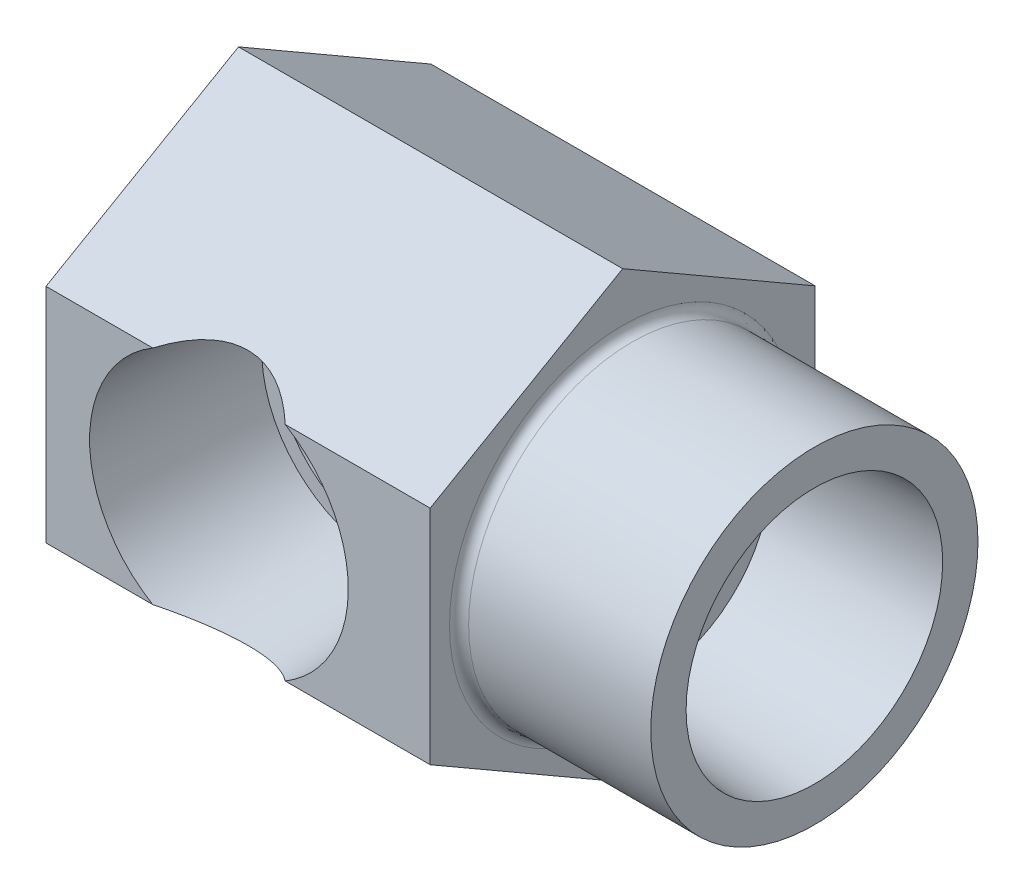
ISO-10303-21;
HEADER;
FILE_DESCRIPTION(('STEP AP214'),'2;1');
FILE_NAME('part.step','',(''),(''),'','','');
FILE_SCHEMA(('AUTOMOTIVE_DESIGN { 1 0 10303 214 1 1 1 1 }'));
ENDSEC;
DATA;
#1=APPLICATION_CONTEXT('core data for automotive mechanical design processes');
#2=APPLICATION_PROTOCOL_DEFINITION('international standard','automotive_design',2000,#1);
#3=PRODUCT_CONTEXT('',#1,'mechanical');
#4=PRODUCT('Part','Part','',(#3));
#5=PRODUCT_RELATED_PRODUCT_CATEGORY('part','',(#4));
#6=PRODUCT_DEFINITION_FORMATION('','',#4);
#7=PRODUCT_DEFINITION_CONTEXT('part definition',#1,'design');
#8=PRODUCT_DEFINITION('design','',#6,#7);
#9=PRODUCT_DEFINITION_SHAPE('','',#8);
#10=(LENGTH_UNIT() NAMED_UNIT(*) SI_UNIT(.MILLI.,.METRE.));
#11=(NAMED_UNIT(*) PLANE_ANGLE_UNIT() SI_UNIT($,.RADIAN.));
#12=(NAMED_UNIT(*) SI_UNIT($,.STERADIAN.) SOLID_ANGLE_UNIT());
#13=UNCERTAINTY_MEASURE_WITH_UNIT(LENGTH_MEASURE(1.E-05),#10,'distance_accuracy_value','');
#14=(GEOMETRIC_REPRESENTATION_CONTEXT(3) GLOBAL_UNCERTAINTY_ASSIGNED_CONTEXT((#13)) GLOBAL_UNIT_ASSIGNED_CONTEXT((#10,
#11,#12)) REPRESENTATION_CONTEXT('',''));
#15=CARTESIAN_POINT('',(0.,0.,0.));
#16=DIRECTION('',(0.,0.,1.));
#17=DIRECTION('',(1.,0.,0.));
#18=AXIS2_PLACEMENT_3D('',#15,#16,#17);
#19=CARTESIAN_POINT('',(-1.651,0.,-3.17499999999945));
#20=DIRECTION('',(-1.,0.,0.));
#21=DIRECTION('',(0.,0.,1.));
#22=AXIS2_PLACEMENT_3D('',#19,#20,#21);
#23=PLANE('',#22);
#24=CARTESIAN_POINT('',(-1.651,0.,-3.17499999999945));
#25=DIRECTION('',(-1.,0.,0.));
#26=DIRECTION('',(0.,0.,1.));
#27=AXIS2_PLACEMENT_3D('',#24,#25,#26);
#28=CIRCLE('',#27,13.49375);
#29=CARTESIAN_POINT('',(-1.651,0.,10.3187500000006));
#30=VERTEX_POINT('',#29);
#31=EDGE_CURVE('E160',#30,#30,#28,.T.);
#32=ORIENTED_EDGE('',*,*,#31,.F.);
#33=EDGE_LOOP('',(#32));
#34=FACE_BOUND('',#33,.T.);
#35=CARTESIAN_POINT('',(-1.651,0.,-3.1749999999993));
#36=DIRECTION('',(-1.,0.,0.));
#37=DIRECTION('',(0.,0.,1.));
#38=AXIS2_PLACEMENT_3D('',#35,#36,#37);
#39=CIRCLE('',#38,10.5814747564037);
#40=CARTESIAN_POINT('',(-1.651,0.,7.40647475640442));
#41=VERTEX_POINT('',#40);
#42=EDGE_CURVE('E108',#41,#41,#39,.T.);
#43=ORIENTED_EDGE('',*,*,#42,.T.);
#44=EDGE_LOOP('',(#43));
#45=FACE_BOUND('',#44,.T.);
#46=ADVANCED_FACE('F16',(#34,#45),#23,.F.);
#47=CARTESIAN_POINT('',(-17.4625,18.3308710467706,-3.175));
#48=DIRECTION('',(0.,-0.866025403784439,-0.5));
#49=DIRECTION('',(0.,0.5,-0.866025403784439));
#50=AXIS2_PLACEMENT_3D('',#47,#48,#49);
#51=PLANE('',#50);
#52=CARTESIAN_POINT('',(-34.8869,-1.05255916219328,30.3980859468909));
#53=DIRECTION('',(0.,-0.866025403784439,-0.5));
#54=DIRECTION('',(0.,-0.5,0.866025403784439));
#55=AXIS2_PLACEMENT_3D('',#52,#53,#54);
#56=ELLIPSE('',#55,23.1910347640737,11.5476466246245);
#57=CARTESIAN_POINT('',(-29.4278693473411,9.16543552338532,12.7));
#58=VERTEX_POINT('',#57);
#59=CARTESIAN_POINT('',(-40.3459306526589,9.16543552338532,12.7));
#60=VERTEX_POINT('',#59);
#61=EDGE_CURVE('E224',#58,#60,#56,.F.);
#62=ORIENTED_EDGE('',*,*,#61,.F.);
#63=DIRECTION('',(-1.,0.,0.));
#64=VECTOR('',#63,1.);
#65=CARTESIAN_POINT('',(-17.4625,9.16543552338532,12.7));
#66=LINE('',#65,#64);
#67=CARTESIAN_POINT('',(-17.4625,9.16543552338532,12.7));
#68=VERTEX_POINT('',#67);
#69=EDGE_CURVE('E208',#68,#58,#66,.T.);
#70=ORIENTED_EDGE('',*,*,#69,.F.);
#71=DIRECTION('',(0.,-0.5,0.866025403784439));
#72=VECTOR('',#71,1.);
#73=CARTESIAN_POINT('',(-17.4625,18.3308710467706,-3.175));
#74=LINE('',#73,#72);
#75=CARTESIAN_POINT('',(-17.4625,18.3308710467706,-3.175));
#76=VERTEX_POINT('',#75);
#77=EDGE_CURVE('E319',#76,#68,#74,.T.);
#78=ORIENTED_EDGE('',*,*,#77,.F.);
#79=DIRECTION('',(-1.,0.,0.));
#80=VECTOR('',#79,1.);
#81=CARTESIAN_POINT('',(-17.4625,18.3308710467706,-3.175));
#82=LINE('',#81,#80);
#83=CARTESIAN_POINT('',(-49.149,18.3308710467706,-3.175));
#84=VERTEX_POINT('',#83);
#85=EDGE_CURVE('E210',#76,#84,#82,.T.);
#86=ORIENTED_EDGE('',*,*,#85,.T.);
#87=DIRECTION('',(0.,-0.5,0.866025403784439));
#88=VECTOR('',#87,1.);
#89=CARTESIAN_POINT('',(-49.149,18.3308710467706,-3.175));
#90=LINE('',#89,#88);
#91=CARTESIAN_POINT('',(-49.149,9.16543552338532,12.7));
#92=VERTEX_POINT('',#91);
#93=EDGE_CURVE('E168',#84,#92,#90,.T.);
#94=ORIENTED_EDGE('',*,*,#93,.T.);
#95=EDGE_CURVE('E207',#60,#92,#66,.T.);
#96=ORIENTED_EDGE('',*,*,#95,.F.);
#97=EDGE_LOOP('',(#62,#70,#78,#86,#94,#96));
#98=FACE_BOUND('',#97,.T.);
#99=ADVANCED_FACE('F259',(#98),#51,.F.);
#100=CARTESIAN_POINT('',(-17.4625,9.16543552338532,12.7));
#101=DIRECTION('',(0.,0.,-1.));
#102=DIRECTION('',(0.,1.,0.));
#103=AXIS2_PLACEMENT_3D('',#100,#101,#102);
#104=PLANE('',#103);
#105=CARTESIAN_POINT('',(-34.8869,0.,12.7));
#106=DIRECTION('',(0.,0.,-1.));
#107=DIRECTION('',(-1.,0.,0.));
#108=AXIS2_PLACEMENT_3D('',#105,#106,#107);
#109=CIRCLE('',#108,10.6680000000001);
#110=CARTESIAN_POINT('',(-40.3459306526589,-9.1654355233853,12.7));
#111=VERTEX_POINT('',#110);
#112=EDGE_CURVE('E20',#111,#60,#109,.T.);
#113=ORIENTED_EDGE('',*,*,#112,.T.);
#114=ORIENTED_EDGE('',*,*,#95,.T.);
#115=DIRECTION('',(0.,-1.,0.));
#116=VECTOR('',#115,1.);
#117=CARTESIAN_POINT('',(-49.149,9.16543552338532,12.7));
#118=LINE('',#117,#116);
#119=CARTESIAN_POINT('',(-49.149,-9.1654355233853,12.7));
#120=VERTEX_POINT('',#119);
#121=EDGE_CURVE('E172',#92,#120,#118,.T.);
#122=ORIENTED_EDGE('',*,*,#121,.T.);
#123=DIRECTION('',(-1.,0.,0.));
#124=VECTOR('',#123,1.);
#125=CARTESIAN_POINT('',(-17.4625,-9.1654355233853,12.7));
#126=LINE('',#125,#124);
#127=EDGE_CURVE('E203',#111,#120,#126,.T.);
#128=ORIENTED_EDGE('',*,*,#127,.F.);
#129=EDGE_LOOP('',(#113,#114,#122,#128));
#130=FACE_BOUND('',#129,.T.);
#131=ADVANCED_FACE('F266',(#130),#104,.F.);
#132=CARTESIAN_POINT('',(-34.8869,0.,12.7));
#133=DIRECTION('',(0.,0.,-1.));
#134=DIRECTION('',(-1.,0.,0.));
#135=AXIS2_PLACEMENT_3D('',#132,#133,#134);
#136=CIRCLE('',#135,10.6680000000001);
#137=CARTESIAN_POINT('',(-29.4278693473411,-9.16543552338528,12.7));
#138=VERTEX_POINT('',#137);
#139=EDGE_CURVE('E52',#58,#138,#136,.T.);
#140=ORIENTED_EDGE('',*,*,#139,.T.);
#141=CARTESIAN_POINT('',(-17.4625,-9.1654355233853,12.7));
#142=VERTEX_POINT('',#141);
#143=EDGE_CURVE('E204',#142,#138,#126,.T.);
#144=ORIENTED_EDGE('',*,*,#143,.F.);
#145=DIRECTION('',(0.,-1.,0.));
#146=VECTOR('',#145,1.);
#147=CARTESIAN_POINT('',(-17.4625,9.16543552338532,12.7));
#148=LINE('',#147,#146);
#149=EDGE_CURVE('E332',#68,#142,#148,.T.);
#150=ORIENTED_EDGE('',*,*,#149,.F.);
#151=ORIENTED_EDGE('',*,*,#69,.T.);
#152=EDGE_LOOP('',(#140,#144,#150,#151));
#153=FACE_BOUND('',#152,.T.);
#154=ADVANCED_FACE('F336',(#153),#104,.F.);
#155=CARTESIAN_POINT('',(-17.4625,-9.1654355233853,12.7));
#156=DIRECTION('',(0.,0.866025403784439,-0.5));
#157=DIRECTION('',(0.,0.5,0.866025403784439));
#158=AXIS2_PLACEMENT_3D('',#155,#156,#157);
#159=PLANE('',#158);
#160=CARTESIAN_POINT('',(-34.8869,1.05255916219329,30.3980859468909));
#161=DIRECTION('',(0.,0.866025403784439,-0.5));
#162=DIRECTION('',(0.,0.5,0.866025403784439));
#163=AXIS2_PLACEMENT_3D('',#160,#161,#162);
#164=ELLIPSE('',#163,23.1910347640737,11.5476466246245);
#165=EDGE_CURVE('E145',#111,#138,#164,.F.);
#166=ORIENTED_EDGE('',*,*,#165,.F.);
#167=ORIENTED_EDGE('',*,*,#127,.T.);
#168=DIRECTION('',(0.,-0.5,-0.866025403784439));
#169=VECTOR('',#168,1.);
#170=CARTESIAN_POINT('',(-49.149,-9.1654355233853,12.7));
#171=LINE('',#170,#169);
#172=CARTESIAN_POINT('',(-49.149,-18.3308710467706,-3.175));
#173=VERTEX_POINT('',#172);
#174=EDGE_CURVE('E175',#120,#173,#171,.T.);
#175=ORIENTED_EDGE('',*,*,#174,.T.);
#176=DIRECTION('',(-1.,0.,0.));
#177=VECTOR('',#176,1.);
#178=CARTESIAN_POINT('',(-17.4625,-18.3308710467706,-3.175));
#179=LINE('',#178,#177);
#180=CARTESIAN_POINT('',(-17.4625,-18.3308710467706,-3.175));
#181=VERTEX_POINT('',#180);
#182=EDGE_CURVE('E201',#181,#173,#179,.T.);
#183=ORIENTED_EDGE('',*,*,#182,.F.);
#184=DIRECTION('',(0.,-0.5,-0.866025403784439));
#185=VECTOR('',#184,1.);
#186=CARTESIAN_POINT('',(-17.4625,-9.1654355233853,12.7));
#187=LINE('',#186,#185);
#188=EDGE_CURVE('E199',#142,#181,#187,.T.);
#189=ORIENTED_EDGE('',*,*,#188,.F.);
#190=ORIENTED_EDGE('',*,*,#143,.T.);
#191=EDGE_LOOP('',(#166,#167,#175,#183,#189,#190));
#192=FACE_BOUND('',#191,.T.);
#193=ADVANCED_FACE('F310',(#192),#159,.F.);
#194=CARTESIAN_POINT('',(-17.4625,-18.3308710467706,-3.175));
#195=DIRECTION('',(0.,0.866025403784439,0.5));
#196=DIRECTION('',(0.,-0.5,0.866025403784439));
#197=AXIS2_PLACEMENT_3D('',#194,#195,#196);
#198=PLANE('',#197);
#199=DIRECTION('',(0.,0.5,-0.866025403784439));
#200=VECTOR('',#199,1.);
#201=CARTESIAN_POINT('',(-49.149,-18.3308710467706,-3.175));
#202=LINE('',#201,#200);
#203=CARTESIAN_POINT('',(-49.149,-9.16543552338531,-19.05));
#204=VERTEX_POINT('',#203);
#205=EDGE_CURVE('E155',#173,#204,#202,.T.);
#206=ORIENTED_EDGE('',*,*,#205,.T.);
#207=DIRECTION('',(-1.,0.,0.));
#208=VECTOR('',#207,1.);
#209=CARTESIAN_POINT('',(-17.4625,-9.16543552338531,-19.05));
#210=LINE('',#209,#208);
#211=CARTESIAN_POINT('',(-17.4625,-9.16543552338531,-19.05));
#212=VERTEX_POINT('',#211);
#213=EDGE_CURVE('E216',#212,#204,#210,.T.);
#214=ORIENTED_EDGE('',*,*,#213,.F.);
#215=DIRECTION('',(0.,0.5,-0.866025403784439));
#216=VECTOR('',#215,1.);
#217=CARTESIAN_POINT('',(-17.4625,-18.3308710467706,-3.175));
#218=LINE('',#217,#216);
#219=EDGE_CURVE('E178',#181,#212,#218,.T.);
#220=ORIENTED_EDGE('',*,*,#219,.F.);
#221=ORIENTED_EDGE('',*,*,#182,.T.);
#222=EDGE_LOOP('',(#206,#214,#220,#221));
#223=FACE_BOUND('',#222,.T.);
#224=ADVANCED_FACE('F272',(#223),#198,.F.);
#225=CARTESIAN_POINT('',(-17.4625,-9.16543552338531,-19.05));
#226=DIRECTION('',(0.,0.,1.));
#227=DIRECTION('',(0.,-1.,0.));
#228=AXIS2_PLACEMENT_3D('',#225,#226,#227);
#229=PLANE('',#228);
#230=DIRECTION('',(0.,1.,0.));
#231=VECTOR('',#230,1.);
#232=CARTESIAN_POINT('',(-49.149,-9.16543552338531,-19.05));
#233=LINE('',#232,#231);
#234=CARTESIAN_POINT('',(-49.149,9.16543552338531,-19.05));
#235=VERTEX_POINT('',#234);
#236=EDGE_CURVE('E159',#204,#235,#233,.T.);
#237=ORIENTED_EDGE('',*,*,#236,.T.);
#238=DIRECTION('',(-1.,0.,0.));
#239=VECTOR('',#238,1.);
#240=CARTESIAN_POINT('',(-17.4625,9.16543552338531,-19.05));
#241=LINE('',#240,#239);
#242=CARTESIAN_POINT('',(-17.4625,9.16543552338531,-19.05));
#243=VERTEX_POINT('',#242);
#244=EDGE_CURVE('E213',#243,#235,#241,.T.);
#245=ORIENTED_EDGE('',*,*,#244,.F.);
#246=DIRECTION('',(0.,1.,0.));
#247=VECTOR('',#246,1.);
#248=CARTESIAN_POINT('',(-17.4625,-9.16543552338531,-19.05));
#249=LINE('',#248,#247);
#250=EDGE_CURVE('E187',#212,#243,#249,.T.);
#251=ORIENTED_EDGE('',*,*,#250,.F.);
#252=ORIENTED_EDGE('',*,*,#213,.T.);
#253=EDGE_LOOP('',(#237,#245,#251,#252));
#254=FACE_BOUND('',#253,.T.);
#255=ADVANCED_FACE('F347',(#254),#229,.F.);
#256=CARTESIAN_POINT('',(-17.4625,9.16543552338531,-19.05));
#257=DIRECTION('',(0.,-0.866025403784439,0.5));
#258=DIRECTION('',(0.,-0.5,-0.866025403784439));
#259=AXIS2_PLACEMENT_3D('',#256,#257,#258);
#260=PLANE('',#259);
#261=DIRECTION('',(0.,0.5,0.866025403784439));
#262=VECTOR('',#261,1.);
#263=CARTESIAN_POINT('',(-49.149,9.16543552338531,-19.05));
#264=LINE('',#263,#262);
#265=EDGE_CURVE('E164',#235,#84,#264,.T.);
#266=ORIENTED_EDGE('',*,*,#265,.T.);
#267=ORIENTED_EDGE('',*,*,#85,.F.);
#268=DIRECTION('',(0.,0.5,0.866025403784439));
#269=VECTOR('',#268,1.);
#270=CARTESIAN_POINT('',(-17.4625,9.16543552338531,-19.05));
#271=LINE('',#270,#269);
#272=EDGE_CURVE('E195',#243,#76,#271,.T.);
#273=ORIENTED_EDGE('',*,*,#272,.F.);
#274=ORIENTED_EDGE('',*,*,#244,.T.);
#275=EDGE_LOOP('',(#266,#267,#273,#274));
#276=FACE_BOUND('',#275,.T.);
#277=ADVANCED_FACE('F289',(#276),#260,.F.);
#278=CARTESIAN_POINT('',(-17.4625,-9.16543552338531,-19.05));
#279=DIRECTION('',(1.,0.,0.));
#280=DIRECTION('',(0.,1.,0.));
#281=AXIS2_PLACEMENT_3D('',#278,#279,#280);
#282=PLANE('',#281);
#283=CARTESIAN_POINT('',(-17.4625,0.,-3.17499999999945));
#284=DIRECTION('',(1.,0.,0.));
#285=DIRECTION('',(0.,1.,0.));
#286=AXIS2_PLACEMENT_3D('',#283,#284,#285);
#287=CIRCLE('',#286,14.28115);
#288=CARTESIAN_POINT('',(-17.4625,14.28115,-3.17499999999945));
#289=VERTEX_POINT('',#288);
#290=EDGE_CURVE('E148',#289,#289,#287,.F.);
#291=ORIENTED_EDGE('',*,*,#290,.T.);
#292=EDGE_LOOP('',(#291));
#293=FACE_BOUND('',#292,.T.);
#294=ORIENTED_EDGE('',*,*,#219,.T.);
#295=ORIENTED_EDGE('',*,*,#250,.T.);
#296=ORIENTED_EDGE('',*,*,#272,.T.);
#297=ORIENTED_EDGE('',*,*,#77,.T.);
#298=ORIENTED_EDGE('',*,*,#149,.T.);
#299=ORIENTED_EDGE('',*,*,#188,.T.);
#300=EDGE_LOOP('',(#294,#295,#296,#297,#298,#299));
#301=FACE_BOUND('',#300,.T.);
#302=ADVANCED_FACE('F280',(#293,#301),#282,.T.);
#303=CARTESIAN_POINT('',(-49.149,-9.16543552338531,-19.05));
#304=DIRECTION('',(1.,0.,0.));
#305=DIRECTION('',(0.,1.,0.));
#306=AXIS2_PLACEMENT_3D('',#303,#304,#305);
#307=PLANE('',#306);
#308=ORIENTED_EDGE('',*,*,#205,.F.);
#309=ORIENTED_EDGE('',*,*,#174,.F.);
#310=ORIENTED_EDGE('',*,*,#121,.F.);
#311=ORIENTED_EDGE('',*,*,#93,.F.);
#312=ORIENTED_EDGE('',*,*,#265,.F.);
#313=ORIENTED_EDGE('',*,*,#236,.F.);
#314=EDGE_LOOP('',(#308,#309,#310,#311,#312,#313));
#315=FACE_BOUND('',#314,.T.);
#316=ADVANCED_FACE('F278',(#315),#307,.F.);
#317=CARTESIAN_POINT('',(0.,0.,-3.17499999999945));
#318=DIRECTION('',(-1.,0.,0.));
#319=DIRECTION('',(0.,0.,1.));
#320=AXIS2_PLACEMENT_3D('',#317,#318,#319);
#321=CYLINDRICAL_SURFACE('',#320,13.49375);
#322=CARTESIAN_POINT('',(-16.6751,0.,-3.17499999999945));
#323=DIRECTION('',(1.,0.,0.));
#324=DIRECTION('',(0.,1.,0.));
#325=AXIS2_PLACEMENT_3D('',#322,#323,#324);
#326=CIRCLE('',#325,13.49375);
#327=CARTESIAN_POINT('',(-16.6751,13.49375,-3.17499999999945));
#328=VERTEX_POINT('',#327);
#329=EDGE_CURVE('E219',#328,#328,#326,.T.);
#330=ORIENTED_EDGE('',*,*,#329,.T.);
#331=EDGE_LOOP('',(#330));
#332=FACE_BOUND('',#331,.T.);
#333=ORIENTED_EDGE('',*,*,#31,.T.);
#334=EDGE_LOOP('',(#333));
#335=FACE_BOUND('',#334,.T.);
#336=ADVANCED_FACE('F255',(#332,#335),#321,.T.);
#337=CARTESIAN_POINT('',(-16.6751,0.,-3.17499999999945));
#338=DIRECTION('',(1.,0.,0.));
#339=DIRECTION('',(0.,1.,0.));
#340=AXIS2_PLACEMENT_3D('',#337,#338,#339);
#341=TOROIDAL_SURFACE('',#340,14.28115,0.7874);
#342=ORIENTED_EDGE('',*,*,#290,.F.);
#343=EDGE_LOOP('',(#342));
#344=FACE_BOUND('',#343,.T.);
#345=ORIENTED_EDGE('',*,*,#329,.F.);
#346=EDGE_LOOP('',(#345));
#347=FACE_BOUND('',#346,.T.);
#348=ADVANCED_FACE('F247',(#344,#347),#341,.F.);
#349=CARTESIAN_POINT('',(-34.8869,0.,12.7));
#350=DIRECTION('',(0.,0.,1.));
#351=DIRECTION('',(1.,0.,0.));
#352=AXIS2_PLACEMENT_3D('',#349,#350,#351);
#353=CONICAL_SURFACE('',#352,10.6680000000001,0.0523598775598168);
#354=CARTESIAN_POINT('',(-26.6383289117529,-5.58441494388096,-0.7874));
#355=CARTESIAN_POINT('',(-26.5420603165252,-5.45817040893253,-0.616715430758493));
#356=CARTESIAN_POINT('',(-26.4461333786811,-5.32525493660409,-0.450678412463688));
#357=CARTESIAN_POINT('',(-26.2565205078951,-5.04565507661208,-0.128693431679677));
#358=CARTESIAN_POINT('',(-26.1628385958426,-4.89894800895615,0.0272371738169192));
#359=CARTESIAN_POINT('',(-25.9786982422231,-4.59023520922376,0.329127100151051));
#360=CARTESIAN_POINT('',(-25.8882810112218,-4.42809211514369,0.474972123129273));
#361=CARTESIAN_POINT('',(-25.7136292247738,-4.08986996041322,0.753265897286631));
#362=CARTESIAN_POINT('',(-25.6293904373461,-3.91380061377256,0.885723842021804));
#363=CARTESIAN_POINT('',(-25.4284582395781,-3.45500926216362,1.19865054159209));
#364=CARTESIAN_POINT('',(-25.3168284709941,-3.16328950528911,1.36963319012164));
#365=CARTESIAN_POINT('',(-25.1689914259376,-2.70455701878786,1.59399431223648));
#366=CARTESIAN_POINT('',(-25.1230202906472,-2.5483046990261,1.66337031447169));
#367=CARTESIAN_POINT('',(-25.0384464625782,-2.22924925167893,1.79050610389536));
#368=CARTESIAN_POINT('',(-24.9998399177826,-2.06644960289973,1.84827196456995));
#369=CARTESIAN_POINT('',(-24.9304993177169,-1.73333358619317,1.95172441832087));
#370=CARTESIAN_POINT('',(-24.8998579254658,-1.56295360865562,1.99726901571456));
#371=CARTESIAN_POINT('',(-24.8478319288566,-1.21766126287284,2.07444766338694));
#372=CARTESIAN_POINT('',(-24.8264473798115,-1.04274886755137,2.10608163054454));
#373=CARTESIAN_POINT('',(-24.7935630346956,-0.689990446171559,2.15467722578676));
#374=CARTESIAN_POINT('',(-24.7820620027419,-0.512144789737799,2.17164068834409));
#375=CARTESIAN_POINT('',(-24.7692989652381,-0.155300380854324,2.1904636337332));
#376=CARTESIAN_POINT('',(-24.7680354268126,0.0236981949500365,2.19232537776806));
#377=CARTESIAN_POINT('',(-24.7752049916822,0.354545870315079,2.18175365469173));
#378=CARTESIAN_POINT('',(-24.782232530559,0.506497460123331,2.1713923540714));
#379=CARTESIAN_POINT('',(-24.8035838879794,0.808808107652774,2.13987184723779));
#380=CARTESIAN_POINT('',(-24.8179100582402,0.959166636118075,2.11870916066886));
#381=CARTESIAN_POINT('',(-24.8535338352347,1.25705536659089,2.06598455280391));
#382=CARTESIAN_POINT('',(-24.8748248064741,1.40458811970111,2.03443252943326));
#383=CARTESIAN_POINT('',(-24.923942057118,1.69610145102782,1.96145414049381));
#384=CARTESIAN_POINT('',(-24.951770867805,1.84008062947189,1.92002395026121));
#385=CARTESIAN_POINT('',(-25.0444872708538,2.26635418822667,1.78154657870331));
#386=CARTESIAN_POINT('',(-25.1185116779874,2.54223704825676,1.67044906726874));
#387=CARTESIAN_POINT('',(-25.2862189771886,3.07302945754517,1.41621525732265));
#388=CARTESIAN_POINT('',(-25.3799570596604,3.32787726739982,1.27298893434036));
#389=CARTESIAN_POINT('',(-25.5643150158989,3.77132074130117,0.987502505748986));
#390=CARTESIAN_POINT('',(-25.6525838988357,3.96368562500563,0.849502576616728));
#391=CARTESIAN_POINT('',(-25.836691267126,4.33245864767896,0.557724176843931));
#392=CARTESIAN_POINT('',(-25.9325379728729,4.50884900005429,0.403928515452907));
#393=CARTESIAN_POINT('',(-26.1286775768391,4.84430237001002,0.0838167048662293));
#394=CARTESIAN_POINT('',(-26.2289334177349,5.0034811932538,-0.0824011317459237));
#395=CARTESIAN_POINT('',(-26.3813666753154,5.23028910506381,-0.340499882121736));
#396=CARTESIAN_POINT('',(-26.4324646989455,5.30382749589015,-0.427898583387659));
#397=CARTESIAN_POINT('',(-26.5351165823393,5.44702033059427,-0.605541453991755));
#398=CARTESIAN_POINT('',(-26.5866703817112,5.51667528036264,-0.695785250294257));
#399=CARTESIAN_POINT('',(-26.6383289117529,5.58441494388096,-0.7874));
#400=B_SPLINE_CURVE_WITH_KNOTS('',3,(#354,#355,#356,#357,#358,#359,#360,#361,#362,#363,#364,
#365,#366,#367,#368,#369,#370,#371,#372,#373,#374,#375,#376,#377,#378,#379,#380,#381,#382,#383,
#384,#385,#386,#387,#388,#389,#390,#391,#392,#393,#394,#395,#396,#397,#398,#399),.UNSPECIFIED.,
.F.,.F.,(4,2,2,2,2,2,2,2,2,2,2,2,2,2,2,2,2,2,2,2,2,2,4),(0.,0.699275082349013,1.39972092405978,
2.10711723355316,2.81402439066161,3.87751940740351,4.40809759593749,4.93839750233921,
5.4746154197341,6.0108365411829,6.54699060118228,7.08306438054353,7.53990630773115,
7.99689552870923,8.45345062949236,8.91018278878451,9.82591785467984,10.7442515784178,
11.5010764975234,12.2587339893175,13.0109264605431,13.3862365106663,13.7614975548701),.UNSPECIFIED.);
#401=CARTESIAN_POINT('',(-26.6383289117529,-5.58441494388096,-0.7874));
#402=VERTEX_POINT('',#401);
#403=CARTESIAN_POINT('',(-26.6383289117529,5.58441494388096,-0.7874));
#404=VERTEX_POINT('',#403);
#405=EDGE_CURVE('E87',#402,#404,#400,.T.);
#406=ORIENTED_EDGE('',*,*,#405,.F.);
#407=CARTESIAN_POINT('',(-34.8869,0.,-0.7874));
#408=DIRECTION('',(0.,0.,-1.));
#409=DIRECTION('',(-1.,0.,0.));
#410=AXIS2_PLACEMENT_3D('',#407,#408,#409);
#411=CIRCLE('',#410,9.9611553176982);
#412=EDGE_CURVE('E105',#402,#404,#411,.T.);
#413=ORIENTED_EDGE('',*,*,#412,.T.);
#414=EDGE_LOOP('',(#406,#413));
#415=FACE_BOUND('',#414,.T.);
#416=ORIENTED_EDGE('',*,*,#61,.T.);
#417=ORIENTED_EDGE('',*,*,#112,.F.);
#418=ORIENTED_EDGE('',*,*,#165,.T.);
#419=ORIENTED_EDGE('',*,*,#139,.F.);
#420=EDGE_LOOP('',(#416,#417,#418,#419));
#421=FACE_BOUND('',#420,.T.);
#422=ADVANCED_FACE('F244',(#415,#421),#353,.F.);
#423=CARTESIAN_POINT('',(-26.15565,0.,-0.7874));
#424=DIRECTION('',(0.,0.,1.));
#425=DIRECTION('',(1.,0.,0.));
#426=AXIS2_PLACEMENT_3D('',#423,#424,#425);
#427=PLANE('',#426);
#428=CARTESIAN_POINT('',(-2.83443733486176,0.,-0.7874));
#429=DIRECTION('',(0.,0.,1.));
#430=DIRECTION('',(-1.,0.,0.));
#431=AXIS2_PLACEMENT_3D('',#428,#429,#430);
#432=ELLIPSE('',#431,40.8178913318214,6.87441215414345);
#433=CARTESIAN_POINT('',(-28.0322361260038,-5.40817064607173,-0.7874));
#434=VERTEX_POINT('',#433);
#435=EDGE_CURVE('E104',#434,#402,#432,.T.);
#436=ORIENTED_EDGE('',*,*,#435,.F.);
#437=CARTESIAN_POINT('',(-34.8869,0.,-0.7874));
#438=DIRECTION('',(0.,0.,-1.));
#439=DIRECTION('',(-1.,0.,0.));
#440=AXIS2_PLACEMENT_3D('',#437,#438,#439);
#441=CIRCLE('',#440,8.73125);
#442=CARTESIAN_POINT('',(-28.0322361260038,5.40817064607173,-0.7874));
#443=VERTEX_POINT('',#442);
#444=EDGE_CURVE('E98',#434,#443,#441,.T.);
#445=ORIENTED_EDGE('',*,*,#444,.T.);
#446=CARTESIAN_POINT('',(-2.83443733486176,0.,-0.7874));
#447=DIRECTION('',(0.,0.,1.));
#448=DIRECTION('',(-1.,0.,0.));
#449=AXIS2_PLACEMENT_3D('',#446,#447,#448);
#450=ELLIPSE('',#449,40.8178913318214,6.87441215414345);
#451=EDGE_CURVE('E80',#404,#443,#450,.T.);
#452=ORIENTED_EDGE('',*,*,#451,.F.);
#453=ORIENTED_EDGE('',*,*,#412,.F.);
#454=EDGE_LOOP('',(#436,#445,#452,#453));
#455=FACE_BOUND('',#454,.T.);
#456=ADVANCED_FACE('F18',(#455),#427,.T.);
#457=CARTESIAN_POINT('',(-34.8869,0.,18.412204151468));
#458=DIRECTION('',(0.,0.,-1.));
#459=DIRECTION('',(-1.,0.,0.));
#460=AXIS2_PLACEMENT_3D('',#457,#458,#459);
#461=CYLINDRICAL_SURFACE('',#460,8.73125);
#462=CARTESIAN_POINT('',(-28.0322361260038,5.40817064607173,-0.7874));
#463=CARTESIAN_POINT('',(-28.0979463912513,5.49145817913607,-0.892313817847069));
#464=CARTESIAN_POINT('',(-28.1640200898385,5.57208052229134,-0.999104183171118));
#465=CARTESIAN_POINT('',(-28.2964088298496,5.72805473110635,-1.21632057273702));
#466=CARTESIAN_POINT('',(-28.3627238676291,5.80340667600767,-1.32674654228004));
#467=CARTESIAN_POINT('',(-28.4953313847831,5.94914385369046,-1.55149207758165));
#468=CARTESIAN_POINT('',(-28.5616230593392,6.01951177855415,-1.66582334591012));
#469=CARTESIAN_POINT('',(-28.6934092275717,6.15502563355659,-1.89797482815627));
#470=CARTESIAN_POINT('',(-28.7589037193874,6.22017155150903,-2.01579505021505));
#471=CARTESIAN_POINT('',(-28.9571237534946,6.41145717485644,-2.38149395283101));
#472=CARTESIAN_POINT('',(-29.0876444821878,6.52918144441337,-2.63505218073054));
#473=CARTESIAN_POINT('',(-29.336109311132,6.74166471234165,-3.157151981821));
#474=CARTESIAN_POINT('',(-29.4540747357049,6.83646300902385,-3.42566693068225));
#475=CARTESIAN_POINT('',(-29.6084435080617,6.9553045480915,-3.82499774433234));
#476=CARTESIAN_POINT('',(-29.6537468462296,6.98939519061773,-3.94942775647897));
#477=CARTESIAN_POINT('',(-29.738838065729,7.05230269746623,-4.20148520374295));
#478=CARTESIAN_POINT('',(-29.778626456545,7.08112004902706,-4.3291123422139));
#479=CARTESIAN_POINT('',(-29.8511507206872,7.13287682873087,-4.58651850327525));
#480=CARTESIAN_POINT('',(-29.8839353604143,7.15585712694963,-4.71627538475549));
#481=CARTESIAN_POINT('',(-29.9414282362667,7.1957114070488,-4.97852483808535));
#482=CARTESIAN_POINT('',(-29.9661363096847,7.21258526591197,-5.11101746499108));
#483=CARTESIAN_POINT('',(-30.0064222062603,7.23990836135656,-5.38042535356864));
#484=CARTESIAN_POINT('',(-30.0218361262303,7.25024241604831,-5.51737749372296));
#485=CARTESIAN_POINT('',(-30.0415970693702,7.2634643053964,-5.79245594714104));
#486=CARTESIAN_POINT('',(-30.0459451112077,7.2663528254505,-5.93058215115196));
#487=CARTESIAN_POINT('',(-30.042805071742,7.26426024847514,-6.20701230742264));
#488=CARTESIAN_POINT('',(-30.0352866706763,7.25925899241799,-6.34531580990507));
#489=CARTESIAN_POINT('',(-30.0083223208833,7.24116476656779,-6.62019877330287));
#490=CARTESIAN_POINT('',(-29.9888782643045,7.22807308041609,-6.75677850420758));
#491=CARTESIAN_POINT('',(-29.9411948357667,7.19551723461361,-7.01402468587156));
#492=CARTESIAN_POINT('',(-29.9139630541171,7.17677416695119,-7.13497302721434));
#493=CARTESIAN_POINT('',(-29.8513161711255,7.13295742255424,-7.37359743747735));
#494=CARTESIAN_POINT('',(-29.8158976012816,7.107881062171,-7.49127209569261));
#495=CARTESIAN_POINT('',(-29.7380192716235,7.05167031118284,-7.72296295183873));
#496=CARTESIAN_POINT('',(-29.6955484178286,7.02052636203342,-7.83697304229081));
#497=CARTESIAN_POINT('',(-29.6049022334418,6.95258566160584,-8.06077632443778));
#498=CARTESIAN_POINT('',(-29.556735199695,6.91579710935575,-8.17057534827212));
#499=CARTESIAN_POINT('',(-29.5063048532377,6.8763305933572,-8.2782521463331));
#500=B_SPLINE_CURVE_WITH_KNOTS('',3,(#462,#463,#464,#465,#466,#467,#468,#469,#470,#471,#472,
#473,#474,#475,#476,#477,#478,#479,#480,#481,#482,#483,#484,#485,#486,#487,#488,#489,#490,#491,
#492,#493,#494,#495,#496,#497,#498,#499),.UNSPECIFIED.,.F.,.F.,(4,2,2,2,2,2,2,2,2,2,2,2,2,2,2,2,
2,2,4),(0.,0.447560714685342,0.895114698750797,1.34415356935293,1.7931934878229,
2.71746289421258,3.64013656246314,4.05015425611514,4.46013404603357,4.86715876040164,
5.27419167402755,5.68820733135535,6.10218487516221,6.51722188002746,6.93219305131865,
7.30785654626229,7.68367949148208,8.06009934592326,8.43597752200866),.UNSPECIFIED.);
#501=CARTESIAN_POINT('',(-29.5063048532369,6.87633059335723,-8.27825214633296));
#502=VERTEX_POINT('',#501);
#503=EDGE_CURVE('E85',#443,#502,#500,.T.);
#504=ORIENTED_EDGE('',*,*,#503,.F.);
#505=ORIENTED_EDGE('',*,*,#444,.F.);
#506=CARTESIAN_POINT('',(-29.5063048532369,-6.87633059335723,-8.27825214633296));
#507=CARTESIAN_POINT('',(-29.558069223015,-6.91684138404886,-8.16772937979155));
#508=CARTESIAN_POINT('',(-29.6074496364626,-6.95453083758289,-8.05496557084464));
#509=CARTESIAN_POINT('',(-29.7001906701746,-7.0239672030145,-7.82499385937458));
#510=CARTESIAN_POINT('',(-29.7435413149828,-7.05570429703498,-7.70777899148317));
#511=CARTESIAN_POINT('',(-29.8227138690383,-7.11274427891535,-7.46954397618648));
#512=CARTESIAN_POINT('',(-29.858550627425,-7.13805987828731,-7.34853188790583));
#513=CARTESIAN_POINT('',(-29.9214999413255,-7.18199174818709,-7.10312383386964));
#514=CARTESIAN_POINT('',(-29.9486174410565,-7.200611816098,-6.97872982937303));
#515=CARTESIAN_POINT('',(-29.993366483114,-7.23109976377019,-6.72603325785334));
#516=CARTESIAN_POINT('',(-30.0108944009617,-7.24289395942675,-6.59770323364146));
#517=CARTESIAN_POINT('',(-30.0354420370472,-7.25935962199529,-6.33957486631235));
#518=CARTESIAN_POINT('',(-30.0424605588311,-7.26403027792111,-6.20977635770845));
#519=CARTESIAN_POINT('',(-30.0460065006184,-7.26639408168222,-5.95037651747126));
#520=CARTESIAN_POINT('',(-30.0425659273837,-7.26410851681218,-5.82077579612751));
#521=CARTESIAN_POINT('',(-30.0258773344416,-7.25294892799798,-5.56246185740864));
#522=CARTESIAN_POINT('',(-30.0126228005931,-7.24407052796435,-5.4337492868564));
#523=CARTESIAN_POINT('',(-29.9521497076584,-7.20317611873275,-4.99666400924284));
#524=CARTESIAN_POINT('',(-29.8834237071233,-7.15620430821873,-4.69245793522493));
#525=CARTESIAN_POINT('',(-29.7541019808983,-7.06341989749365,-4.24794103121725));
#526=CARTESIAN_POINT('',(-29.7062972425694,-7.02852450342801,-4.10098491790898));
#527=CARTESIAN_POINT('',(-29.6037812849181,-6.95179878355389,-3.81129128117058));
#528=CARTESIAN_POINT('',(-29.5490698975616,-6.90996828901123,-3.66855386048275));
#529=CARTESIAN_POINT('',(-29.3861746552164,-6.7819382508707,-3.26902744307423));
#530=CARTESIAN_POINT('',(-29.2717176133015,-6.68801081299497,-3.01727926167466));
#531=CARTESIAN_POINT('',(-29.0326398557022,-6.47978302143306,-2.52714005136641));
#532=CARTESIAN_POINT('',(-28.9080072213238,-6.36545858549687,-2.28876525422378));
#533=CARTESIAN_POINT('',(-28.7195387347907,-6.18108482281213,-1.944821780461));
#534=CARTESIAN_POINT('',(-28.6574876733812,-6.11859839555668,-1.83414671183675));
#535=CARTESIAN_POINT('',(-28.5327573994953,-5.98896335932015,-1.61591558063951));
#536=CARTESIAN_POINT('',(-28.4700781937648,-5.92181480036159,-1.50835948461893));
#537=CARTESIAN_POINT('',(-28.3446982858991,-5.78299684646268,-1.29666789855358));
#538=CARTESIAN_POINT('',(-28.2819979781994,-5.71133841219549,-1.19252498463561));
#539=CARTESIAN_POINT('',(-28.1568357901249,-5.56330490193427,-0.987494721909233));
#540=CARTESIAN_POINT('',(-28.0943739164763,-5.4869296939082,-0.886607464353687));
#541=CARTESIAN_POINT('',(-28.0322361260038,-5.40817064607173,-0.7874));
#542=B_SPLINE_CURVE_WITH_KNOTS('',3,(#506,#507,#508,#509,#510,#511,#512,#513,#514,#515,#516,
#517,#518,#519,#520,#521,#522,#523,#524,#525,#526,#527,#528,#529,#530,#531,#532,#533,#534,#535,
#536,#537,#538,#539,#540,#541),.UNSPECIFIED.,.F.,.F.,(4,2,2,2,2,2,2,2,2,2,2,2,2,2,2,2,2,4),(0.,
0.385821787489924,0.772274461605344,1.1579560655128,1.5434185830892,1.93296801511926,
2.32256179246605,2.71096454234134,3.09962533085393,4.03965704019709,4.51475161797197,
4.98985775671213,5.86453843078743,6.74025873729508,7.16447248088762,7.58868167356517,
8.01189696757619,8.43512411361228),.UNSPECIFIED.);
#543=CARTESIAN_POINT('',(-29.5063048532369,-6.87633059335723,-8.27825214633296));
#544=VERTEX_POINT('',#543);
#545=EDGE_CURVE('E583',#544,#434,#542,.T.);
#546=ORIENTED_EDGE('',*,*,#545,.F.);
#547=CARTESIAN_POINT('',(-34.8869,0.,-8.27825214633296));
#548=DIRECTION('',(0.,0.,-1.));
#549=DIRECTION('',(-1.,0.,0.));
#550=AXIS2_PLACEMENT_3D('',#547,#548,#549);
#551=CIRCLE('',#550,8.73125);
#552=EDGE_CURVE('E100',#544,#502,#551,.T.);
#553=ORIENTED_EDGE('',*,*,#552,.T.);
#554=EDGE_LOOP('',(#504,#505,#546,#553));
#555=FACE_BOUND('',#554,.T.);
#556=ADVANCED_FACE('F96',(#555),#461,.F.);
#557=CARTESIAN_POINT('',(-34.8869,0.,-8.27825214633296));
#558=DIRECTION('',(0.,0.,1.));
#559=DIRECTION('',(1.,0.,0.));
#560=AXIS2_PLACEMENT_3D('',#557,#558,#559);
#561=CONICAL_SURFACE('',#560,8.73125,1.04719755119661);
#562=CARTESIAN_POINT('',(-37.577743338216,0.,-11.7656825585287));
#563=CARTESIAN_POINT('',(-37.5777436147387,-0.0345847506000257,-11.7656827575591));
#564=CARTESIAN_POINT('',(-37.5774465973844,-0.0691695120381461,-11.7654689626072));
#565=CARTESIAN_POINT('',(-37.5761409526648,-0.145248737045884,-11.7645291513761));
#566=CARTESIAN_POINT('',(-37.5750017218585,-0.186739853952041,-11.7637091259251));
#567=CARTESIAN_POINT('',(-37.5718285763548,-0.270836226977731,-11.7614250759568));
#568=CARTESIAN_POINT('',(-37.5697704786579,-0.313440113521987,-11.7599436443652));
#569=CARTESIAN_POINT('',(-37.5659863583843,-0.377764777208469,-11.7572198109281));
#570=CARTESIAN_POINT('',(-37.5645896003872,-0.399515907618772,-11.7562144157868));
#571=CARTESIAN_POINT('',(-37.5600503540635,-0.464746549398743,-11.752947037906));
#572=CARTESIAN_POINT('',(-37.5565595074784,-0.508190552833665,-11.7504343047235));
#573=CARTESIAN_POINT('',(-37.548662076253,-0.594958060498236,-11.7447496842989));
#574=CARTESIAN_POINT('',(-37.5442552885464,-0.63828153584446,-11.7415776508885));
#575=CARTESIAN_POINT('',(-37.5198521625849,-0.855471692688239,-11.7240121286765));
#576=CARTESIAN_POINT('',(-37.4929841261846,-1.02824837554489,-11.7046723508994));
#577=CARTESIAN_POINT('',(-37.425992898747,-1.36975220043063,-11.656451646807));
#578=CARTESIAN_POINT('',(-37.3858684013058,-1.53847894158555,-11.6275697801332));
#579=CARTESIAN_POINT('',(-37.2809513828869,-1.91864898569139,-11.5520498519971));
#580=CARTESIAN_POINT('',(-37.2123858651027,-2.12850913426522,-11.5026959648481));
#581=CARTESIAN_POINT('',(-37.059851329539,-2.5396453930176,-11.3929006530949));
#582=CARTESIAN_POINT('',(-36.9758657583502,-2.74091198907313,-11.3324473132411));
#583=CARTESIAN_POINT('',(-36.7946198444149,-3.13754071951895,-11.2019853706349));
#584=CARTESIAN_POINT('',(-36.6972010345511,-3.33279199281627,-11.1318627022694));
#585=CARTESIAN_POINT('',(-36.5438266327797,-3.61961695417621,-11.0214628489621));
#586=CARTESIAN_POINT('',(-36.4915073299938,-3.71419501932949,-10.9838030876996));
#587=CARTESIAN_POINT('',(-36.3847072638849,-3.90147871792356,-10.9069277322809));
#588=CARTESIAN_POINT('',(-36.330226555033,-3.99418439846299,-10.8677121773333));
#589=CARTESIAN_POINT('',(-36.1605129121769,-4.27529961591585,-10.7455512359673));
#590=CARTESIAN_POINT('',(-36.0421670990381,-4.46086230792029,-10.6603651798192));
#591=CARTESIAN_POINT('',(-35.7990485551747,-4.82551166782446,-10.4853669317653));
#592=CARTESIAN_POINT('',(-35.6742740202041,-5.00459649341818,-10.3955534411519));
#593=CARTESIAN_POINT('',(-35.4194632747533,-5.35730876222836,-10.2121390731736));
#594=CARTESIAN_POINT('',(-35.2894216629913,-5.53093026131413,-10.1185343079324));
#595=CARTESIAN_POINT('',(-35.0251875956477,-5.87326085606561,-9.9283369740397));
#596=CARTESIAN_POINT('',(-34.8909955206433,-6.04197039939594,-9.83174467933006));
#597=CARTESIAN_POINT('',(-34.6184212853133,-6.37608903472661,-9.63554404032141));
#598=CARTESIAN_POINT('',(-34.4800196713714,-6.54147396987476,-9.53592169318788));
#599=CARTESIAN_POINT('',(-34.2003425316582,-6.86851077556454,-9.33460833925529));
#600=CARTESIAN_POINT('',(-34.0590669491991,-7.03016257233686,-9.23291729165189));
#601=CARTESIAN_POINT('',(-33.7741853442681,-7.35011092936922,-9.02785773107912));
#602=CARTESIAN_POINT('',(-33.6305806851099,-7.50840933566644,-8.92449019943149));
#603=CARTESIAN_POINT('',(-33.3413238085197,-7.82214312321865,-8.71628129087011));
#604=CARTESIAN_POINT('',(-33.1956715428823,-7.97757843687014,-8.61143987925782));
#605=CARTESIAN_POINT('',(-32.7858167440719,-8.4088304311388,-8.31642383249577));
#606=CARTESIAN_POINT('',(-32.5196663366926,-8.68183802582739,-8.12484710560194));
#607=CARTESIAN_POINT('',(-31.9829894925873,-9.22131517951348,-7.73854375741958));
#608=CARTESIAN_POINT('',(-31.712462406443,-9.48778375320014,-7.54381666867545));
#609=CARTESIAN_POINT('',(-31.1713312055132,-10.0120722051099,-7.15430704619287));
#610=CARTESIAN_POINT('',(-30.9007692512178,-10.2699582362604,-6.95955485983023));
#611=CARTESIAN_POINT('',(-30.4929332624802,-10.6534654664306,-6.66599196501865));
#612=CARTESIAN_POINT('',(-30.3566741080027,-10.7807307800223,-6.56791177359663));
#613=CARTESIAN_POINT('',(-30.0835419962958,-11.034253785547,-6.37130957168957));
#614=CARTESIAN_POINT('',(-29.9466690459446,-11.1605114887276,-6.27278756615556));
#615=CARTESIAN_POINT('',(-29.8095188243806,-11.2863106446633,-6.1740659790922));
#616=B_SPLINE_CURVE_WITH_KNOTS('',3,(#562,#563,#564,#565,#566,#567,#568,#569,#570,#571,#572,
#573,#574,#575,#576,#577,#578,#579,#580,#581,#582,#583,#584,#585,#586,#587,#588,#589,#590,#591,
#592,#593,#594,#595,#596,#597,#598,#599,#600,#601,#602,#603,#604,#605,#606,#607,#608,#609,#610,
#611,#612,#613,#614,#615),.UNSPECIFIED.,.F.,.F.,(4,2,2,2,2,2,2,2,2,2,2,2,2,2,2,2,2,2,2,2,2,2,2,
2,2,2,4),(0.,0.103752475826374,0.22828382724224,0.35630580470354,0.421761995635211,
0.552712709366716,0.683692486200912,1.21043390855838,1.73722725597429,2.41467290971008,
3.09285009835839,3.77984901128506,4.12318652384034,4.46651538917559,5.17421099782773,
5.88210631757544,6.59074692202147,7.29932273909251,8.01191882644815,8.7245289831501,
9.43673608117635,10.1489599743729,11.4289332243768,12.70909817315,13.9734629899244,
14.6054764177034,15.2374827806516),.UNSPECIFIED.);
#617=CARTESIAN_POINT('',(-37.577743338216,0.,-11.7656825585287));
#618=VERTEX_POINT('',#617);
#619=CARTESIAN_POINT('',(-34.2126512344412,-6.85315347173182,-9.34346822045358));
#620=VERTEX_POINT('',#619);
#621=EDGE_CURVE('E10',#618,#620,#616,.T.);
#622=ORIENTED_EDGE('',*,*,#621,.F.);
#623=CARTESIAN_POINT('',(-37.577743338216,0.,-11.7656825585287));
#624=CARTESIAN_POINT('',(-37.5777436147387,0.0345847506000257,-11.7656827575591));
#625=CARTESIAN_POINT('',(-37.5774465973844,0.0691695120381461,-11.7654689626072));
#626=CARTESIAN_POINT('',(-37.5761409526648,0.145248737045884,-11.7645291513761));
#627=CARTESIAN_POINT('',(-37.5750017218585,0.186739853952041,-11.7637091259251));
#628=CARTESIAN_POINT('',(-37.5718285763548,0.270836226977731,-11.7614250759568));
#629=CARTESIAN_POINT('',(-37.5697704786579,0.313440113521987,-11.7599436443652));
#630=CARTESIAN_POINT('',(-37.5659863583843,0.377764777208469,-11.7572198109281));
#631=CARTESIAN_POINT('',(-37.5645896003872,0.399515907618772,-11.7562144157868));
#632=CARTESIAN_POINT('',(-37.5600503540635,0.464746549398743,-11.752947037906));
#633=CARTESIAN_POINT('',(-37.5565595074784,0.508190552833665,-11.7504343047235));
#634=CARTESIAN_POINT('',(-37.548662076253,0.594958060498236,-11.7447496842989));
#635=CARTESIAN_POINT('',(-37.5442552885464,0.63828153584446,-11.7415776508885));
#636=CARTESIAN_POINT('',(-37.5198521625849,0.855471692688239,-11.7240121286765));
#637=CARTESIAN_POINT('',(-37.4929841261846,1.02824837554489,-11.7046723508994));
#638=CARTESIAN_POINT('',(-37.425992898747,1.36975220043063,-11.656451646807));
#639=CARTESIAN_POINT('',(-37.3858684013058,1.53847894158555,-11.6275697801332));
#640=CARTESIAN_POINT('',(-37.2809513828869,1.91864898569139,-11.5520498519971));
#641=CARTESIAN_POINT('',(-37.2123858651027,2.12850913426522,-11.5026959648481));
#642=CARTESIAN_POINT('',(-37.059851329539,2.5396453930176,-11.3929006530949));
#643=CARTESIAN_POINT('',(-36.9758657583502,2.74091198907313,-11.3324473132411));
#644=CARTESIAN_POINT('',(-36.7946198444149,3.13754071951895,-11.2019853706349));
#645=CARTESIAN_POINT('',(-36.6972010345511,3.33279199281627,-11.1318627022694));
#646=CARTESIAN_POINT('',(-36.5438266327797,3.61961695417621,-11.0214628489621));
#647=CARTESIAN_POINT('',(-36.4915073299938,3.71419501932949,-10.9838030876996));
#648=CARTESIAN_POINT('',(-36.3847072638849,3.90147871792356,-10.9069277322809));
#649=CARTESIAN_POINT('',(-36.330226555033,3.99418439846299,-10.8677121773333));
#650=CARTESIAN_POINT('',(-36.1605129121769,4.27529961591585,-10.7455512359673));
#651=CARTESIAN_POINT('',(-36.0421670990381,4.46086230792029,-10.6603651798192));
#652=CARTESIAN_POINT('',(-35.7990485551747,4.82551166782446,-10.4853669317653));
#653=CARTESIAN_POINT('',(-35.6742740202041,5.00459649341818,-10.3955534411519));
#654=CARTESIAN_POINT('',(-35.4194632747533,5.35730876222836,-10.2121390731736));
#655=CARTESIAN_POINT('',(-35.2894216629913,5.53093026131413,-10.1185343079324));
#656=CARTESIAN_POINT('',(-35.0251875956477,5.87326085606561,-9.9283369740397));
#657=CARTESIAN_POINT('',(-34.8909955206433,6.04197039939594,-9.83174467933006));
#658=CARTESIAN_POINT('',(-34.6184212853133,6.37608903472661,-9.63554404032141));
#659=CARTESIAN_POINT('',(-34.4800196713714,6.54147396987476,-9.53592169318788));
#660=CARTESIAN_POINT('',(-34.2003425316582,6.86851077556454,-9.33460833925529));
#661=CARTESIAN_POINT('',(-34.0590669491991,7.03016257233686,-9.23291729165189));
#662=CARTESIAN_POINT('',(-33.7741853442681,7.35011092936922,-9.02785773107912));
#663=CARTESIAN_POINT('',(-33.6305806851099,7.50840933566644,-8.92449019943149));
#664=CARTESIAN_POINT('',(-33.3413238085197,7.82214312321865,-8.71628129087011));
#665=CARTESIAN_POINT('',(-33.1956715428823,7.97757843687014,-8.61143987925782));
#666=CARTESIAN_POINT('',(-32.7858167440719,8.4088304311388,-8.31642383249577));
#667=CARTESIAN_POINT('',(-32.5196663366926,8.68183802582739,-8.12484710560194));
#668=CARTESIAN_POINT('',(-31.9829894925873,9.22131517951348,-7.73854375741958));
#669=CARTESIAN_POINT('',(-31.712462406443,9.48778375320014,-7.54381666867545));
#670=CARTESIAN_POINT('',(-31.1713312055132,10.0120722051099,-7.15430704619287));
#671=CARTESIAN_POINT('',(-30.9007692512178,10.2699582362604,-6.95955485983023));
#672=CARTESIAN_POINT('',(-30.4929332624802,10.6534654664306,-6.66599196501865));
#673=CARTESIAN_POINT('',(-30.3566741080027,10.7807307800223,-6.56791177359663));
#674=CARTESIAN_POINT('',(-30.0835419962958,11.034253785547,-6.37130957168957));
#675=CARTESIAN_POINT('',(-29.9466690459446,11.1605114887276,-6.27278756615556));
#676=CARTESIAN_POINT('',(-29.8095188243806,11.2863106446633,-6.1740659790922));
#677=B_SPLINE_CURVE_WITH_KNOTS('',3,(#623,#624,#625,#626,#627,#628,#629,#630,#631,#632,#633,
#634,#635,#636,#637,#638,#639,#640,#641,#642,#643,#644,#645,#646,#647,#648,#649,#650,#651,#652,
#653,#654,#655,#656,#657,#658,#659,#660,#661,#662,#663,#664,#665,#666,#667,#668,#669,#670,#671,
#672,#673,#674,#675,#676),.UNSPECIFIED.,.F.,.F.,(4,2,2,2,2,2,2,2,2,2,2,2,2,2,2,2,2,2,2,2,2,2,2,
2,2,2,4),(0.,0.103752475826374,0.22828382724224,0.35630580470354,0.421761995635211,
0.552712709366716,0.683692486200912,1.21043390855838,1.73722725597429,2.41467290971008,
3.09285009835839,3.77984901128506,4.12318652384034,4.46651538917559,5.17421099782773,
5.88210631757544,6.59074692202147,7.29932273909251,8.01191882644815,8.7245289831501,
9.43673608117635,10.1489599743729,11.4289332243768,12.70909817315,13.9734629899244,
14.6054764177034,15.2374827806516),.UNSPECIFIED.);
#678=CARTESIAN_POINT('',(-34.2126512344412,6.85315347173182,-9.34346822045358));
#679=VERTEX_POINT('',#678);
#680=EDGE_CURVE('E26',#679,#618,#677,.F.);
#681=ORIENTED_EDGE('',*,*,#680,.F.);
#682=CARTESIAN_POINT('',(-29.5063048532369,6.87633059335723,-8.27825214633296));
#683=CARTESIAN_POINT('',(-29.6954551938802,6.86585542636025,-8.35028324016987));
#684=CARTESIAN_POINT('',(-29.8853500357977,6.85566992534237,-8.42049097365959));
#685=CARTESIAN_POINT('',(-30.2669815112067,6.83651243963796,-8.55623767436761));
#686=CARTESIAN_POINT('',(-30.4587191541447,6.82754116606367,-8.62177389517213));
#687=CARTESIAN_POINT('',(-30.842435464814,6.81153235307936,-8.74650553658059));
#688=CARTESIAN_POINT('',(-31.0343964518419,6.80447814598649,-8.80575268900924));
#689=CARTESIAN_POINT('',(-31.4204181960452,6.79295300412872,-8.91724451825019));
#690=CARTESIAN_POINT('',(-31.6144787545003,6.78848182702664,-8.96948985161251));
#691=CARTESIAN_POINT('',(-32.0055375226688,6.78290716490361,-9.06566755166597));
#692=CARTESIAN_POINT('',(-32.2025442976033,6.78181702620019,-9.10956633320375));
#693=CARTESIAN_POINT('',(-32.5985092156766,6.78378510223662,-9.18717923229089));
#694=CARTESIAN_POINT('',(-32.797466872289,6.7868423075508,-9.2208958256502));
#695=CARTESIAN_POINT('',(-33.1986408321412,6.79765381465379,-9.27695914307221));
#696=CARTESIAN_POINT('',(-33.4008704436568,6.80544831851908,-9.29920550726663));
#697=CARTESIAN_POINT('',(-33.7048703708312,6.82072540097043,-9.32302088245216));
#698=CARTESIAN_POINT('',(-33.8063763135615,6.82641997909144,-9.3293679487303));
#699=CARTESIAN_POINT('',(-34.0094747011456,6.83894747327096,-9.33884081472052));
#700=CARTESIAN_POINT('',(-34.111067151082,6.84578046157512,-9.34196640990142));
#701=CARTESIAN_POINT('',(-34.2126512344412,6.85315347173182,-9.34346822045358));
#702=B_SPLINE_CURVE_WITH_KNOTS('',3,(#682,#683,#684,#685,#686,#687,#688,#689,#690,#691,#692,
#693,#694,#695,#696,#697,#698,#699,#700,#701),.UNSPECIFIED.,.F.,.F.,(4,2,2,2,2,2,2,2,2,4),(0.,
0.608055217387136,1.21646501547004,1.81940230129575,2.42228301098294,3.02754052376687,
3.63265074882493,4.24296924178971,4.5485090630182,4.85406828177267),.UNSPECIFIED.);
#703=EDGE_CURVE('E101',#502,#679,#702,.T.);
#704=ORIENTED_EDGE('',*,*,#703,.F.);
#705=ORIENTED_EDGE('',*,*,#552,.F.);
#706=CARTESIAN_POINT('',(-34.2126512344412,-6.85315347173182,-9.34346822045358));
#707=CARTESIAN_POINT('',(-34.0775768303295,-6.843336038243,-9.34149176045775));
#708=CARTESIAN_POINT('',(-33.9424780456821,-6.83449433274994,-9.33661180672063));
#709=CARTESIAN_POINT('',(-33.6725170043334,-6.81885474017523,-9.32117861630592));
#710=CARTESIAN_POINT('',(-33.5376547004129,-6.81205638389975,-9.31062668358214));
#711=CARTESIAN_POINT('',(-33.2687436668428,-6.80060633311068,-9.28401724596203));
#712=CARTESIAN_POINT('',(-33.1346937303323,-6.79594904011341,-9.26797429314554));
#713=CARTESIAN_POINT('',(-32.8672648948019,-6.78870523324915,-9.2306970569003));
#714=CARTESIAN_POINT('',(-32.7338860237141,-6.78611880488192,-9.20946255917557));
#715=CARTESIAN_POINT('',(-32.3376013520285,-6.78132030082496,-9.13903091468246));
#716=CARTESIAN_POINT('',(-32.0758913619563,-6.7819605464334,-9.08282762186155));
#717=CARTESIAN_POINT('',(-31.5562156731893,-6.78925724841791,-8.95530023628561));
#718=CARTESIAN_POINT('',(-31.2982523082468,-6.79591730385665,-8.88396711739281));
#719=CARTESIAN_POINT('',(-30.9127577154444,-6.80904995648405,-8.76787545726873));
#720=CARTESIAN_POINT('',(-30.7838442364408,-6.81398478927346,-8.72743179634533));
#721=CARTESIAN_POINT('',(-30.526929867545,-6.824687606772,-8.64397378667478));
#722=CARTESIAN_POINT('',(-30.3989287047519,-6.83045533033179,-8.60096024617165));
#723=CARTESIAN_POINT('',(-30.1430738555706,-6.84265167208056,-8.51246951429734));
#724=CARTESIAN_POINT('',(-30.0152243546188,-6.8490835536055,-8.46698073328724));
#725=CARTESIAN_POINT('',(-29.7602404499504,-6.86240696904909,-8.37402542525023));
#726=CARTESIAN_POINT('',(-29.6331061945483,-6.86929859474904,-8.32655850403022));
#727=CARTESIAN_POINT('',(-29.506304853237,-6.87633059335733,-8.27825214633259));
#728=B_SPLINE_CURVE_WITH_KNOTS('',3,(#706,#707,#708,#709,#710,#711,#712,#713,#714,#715,#716,
#717,#718,#719,#720,#721,#722,#723,#724,#725,#726,#727),.UNSPECIFIED.,.F.,.F.,(4,2,2,2,2,2,2,2,
2,2,4),(0.,0.406295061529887,0.81249675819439,1.21763018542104,1.62278033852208,
2.42508553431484,3.22787072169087,3.63344317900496,4.03888874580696,4.44643092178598,
4.85405470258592),.UNSPECIFIED.);
#729=EDGE_CURVE('E118',#620,#544,#728,.T.);
#730=ORIENTED_EDGE('',*,*,#729,.F.);
#731=EDGE_LOOP('',(#622,#681,#704,#705,#730));
#732=FACE_BOUND('',#731,.T.);
#733=ADVANCED_FACE('F130',(#732),#561,.F.);
#734=CARTESIAN_POINT('',(0.,0.,-3.1749999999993));
#735=DIRECTION('',(1.,0.,0.));
#736=DIRECTION('',(0.,0.,-1.));
#737=AXIS2_PLACEMENT_3D('',#734,#735,#736);
#738=CONICAL_SURFACE('',#737,10.668,0.05235987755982);
#739=CARTESIAN_POINT('',(-15.1384,0.,-3.1749999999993));
#740=DIRECTION('',(1.,0.,0.));
#741=DIRECTION('',(0.,0.,-1.));
#742=AXIS2_PLACEMENT_3D('',#739,#740,#741);
#743=CIRCLE('',#742,9.87463007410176);
#744=CARTESIAN_POINT('',(-15.1384,0.,-13.0496300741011));
#745=VERTEX_POINT('',#744);
#746=EDGE_CURVE('E152',#745,#745,#743,.F.);
#747=ORIENTED_EDGE('',*,*,#746,.T.);
#748=EDGE_LOOP('',(#747));
#749=FACE_BOUND('',#748,.T.);
#750=ORIENTED_EDGE('',*,*,#42,.F.);
#751=EDGE_LOOP('',(#750));
#752=FACE_BOUND('',#751,.T.);
#753=ADVANCED_FACE('F276',(#749,#752),#738,.F.);
#754=CARTESIAN_POINT('',(-15.1384,0.,-3.1749999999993));
#755=DIRECTION('',(1.,0.,0.));
#756=DIRECTION('',(0.,0.,-1.));
#757=AXIS2_PLACEMENT_3D('',#754,#755,#756);
#758=PLANE('',#757);
#759=CARTESIAN_POINT('',(-15.1384,0.,-3.45802356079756));
#760=DIRECTION('',(1.,0.,0.));
#761=DIRECTION('',(0.,0.,-1.));
#762=AXIS2_PLACEMENT_3D('',#759,#760,#761);
#763=ELLIPSE('',#762,7.16645788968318,7.0634424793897);
#764=CARTESIAN_POINT('',(-15.1384,0.,-10.6244814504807));
#765=VERTEX_POINT('',#764);
#766=EDGE_CURVE('E143',#765,#765,#763,.T.);
#767=ORIENTED_EDGE('',*,*,#766,.F.);
#768=EDGE_LOOP('',(#767));
#769=FACE_BOUND('',#768,.T.);
#770=ORIENTED_EDGE('',*,*,#746,.F.);
#771=EDGE_LOOP('',(#770));
#772=FACE_BOUND('',#771,.T.);
#773=ADVANCED_FACE('F274',(#769,#772),#758,.T.);
#774=CARTESIAN_POINT('',(-12.3006690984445,0.,-2.955241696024));
#775=DIRECTION('',(-0.985627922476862,0.,-0.168930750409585));
#776=DIRECTION('',(-0.168930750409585,0.,0.985627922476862));
#777=AXIS2_PLACEMENT_3D('',#774,#775,#776);
#778=CONICAL_SURFACE('',#777,7.02495489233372,0.0133606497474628);
#779=ORIENTED_EDGE('',*,*,#435,.T.);
#780=ORIENTED_EDGE('',*,*,#405,.T.);
#781=ORIENTED_EDGE('',*,*,#451,.T.);
#782=ORIENTED_EDGE('',*,*,#503,.T.);
#783=ORIENTED_EDGE('',*,*,#703,.T.);
#784=CARTESIAN_POINT('',(-34.2126512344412,-6.85315347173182,-9.34346822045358));
#785=CARTESIAN_POINT('',(-34.190890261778,-6.78717278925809,-9.51688387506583));
#786=CARTESIAN_POINT('',(-34.1694550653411,-6.71449247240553,-9.68778827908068));
#787=CARTESIAN_POINT('',(-34.1273578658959,-6.55622095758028,-10.0235876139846));
#788=CARTESIAN_POINT('',(-34.1066957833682,-6.47063109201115,-10.1884831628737));
#789=CARTESIAN_POINT('',(-34.0662591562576,-6.28700253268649,-10.5113360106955));
#790=CARTESIAN_POINT('',(-34.0464847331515,-6.1889621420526,-10.6692923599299));
#791=CARTESIAN_POINT('',(-34.0079385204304,-5.98101190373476,-10.9773283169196));
#792=CARTESIAN_POINT('',(-33.9891668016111,-5.87110121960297,-11.1274073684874));
#793=CARTESIAN_POINT('',(-33.9508440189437,-5.62805985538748,-11.433921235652));
#794=CARTESIAN_POINT('',(-33.9314139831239,-5.49370320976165,-11.5894013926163));
#795=CARTESIAN_POINT('',(-33.8940356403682,-5.21220743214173,-11.8886298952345));
#796=CARTESIAN_POINT('',(-33.8760879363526,-5.06506314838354,-12.0323734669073));
#797=CARTESIAN_POINT('',(-33.841811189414,-4.75911828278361,-12.3070020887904));
#798=CARTESIAN_POINT('',(-33.8254817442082,-4.60032061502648,-12.437890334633));
#799=CARTESIAN_POINT('',(-33.7945494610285,-4.27216337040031,-12.685912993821));
#800=CARTESIAN_POINT('',(-33.7799466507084,-4.10280362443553,-12.8030471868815));
#801=CARTESIAN_POINT('',(-33.7525823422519,-3.75490014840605,-13.0226126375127));
#802=CARTESIAN_POINT('',(-33.7398190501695,-3.57636559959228,-13.1250582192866));
#803=CARTESIAN_POINT('',(-33.7162044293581,-3.21122398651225,-13.3146521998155));
#804=CARTESIAN_POINT('',(-33.7053531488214,-3.02461671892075,-13.4018002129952));
#805=CARTESIAN_POINT('',(-33.6856384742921,-2.64467669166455,-13.5601651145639));
#806=CARTESIAN_POINT('',(-33.6767749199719,-2.4513444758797,-13.6313832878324));
#807=CARTESIAN_POINT('',(-33.6610928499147,-2.05924859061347,-13.7574086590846));
#808=CARTESIAN_POINT('',(-33.6542750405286,-1.86048307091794,-13.8122101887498));
#809=CARTESIAN_POINT('',(-33.6427422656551,-1.45923724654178,-13.9049212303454));
#810=CARTESIAN_POINT('',(-33.6380248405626,-1.25676157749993,-13.9428505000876));
#811=CARTESIAN_POINT('',(-33.6307134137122,-0.849304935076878,-14.0016399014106));
#812=CARTESIAN_POINT('',(-33.6281194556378,-0.644323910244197,-14.0224996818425));
#813=CARTESIAN_POINT('',(-33.625073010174,-0.23333183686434,-14.0469984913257));
#814=CARTESIAN_POINT('',(-33.6246203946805,-0.0273208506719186,-14.0506385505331));
#815=CARTESIAN_POINT('',(-33.6258593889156,0.384276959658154,-14.0406746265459));
#816=CARTESIAN_POINT('',(-33.6275509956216,0.589863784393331,-14.0270706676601));
#817=CARTESIAN_POINT('',(-33.6330656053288,0.999059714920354,-13.9827261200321));
#818=CARTESIAN_POINT('',(-33.6368876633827,1.20266965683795,-13.9519931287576));
#819=CARTESIAN_POINT('',(-33.6466362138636,1.60655270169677,-13.873616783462));
#820=CARTESIAN_POINT('',(-33.6525626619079,1.80682587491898,-13.825973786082));
#821=CARTESIAN_POINT('',(-33.6664804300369,2.20264660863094,-13.7141098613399));
#822=CARTESIAN_POINT('',(-33.6744720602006,2.39819345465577,-13.6498864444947));
#823=CARTESIAN_POINT('',(-33.6924616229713,2.7830705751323,-13.5053512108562));
#824=CARTESIAN_POINT('',(-33.7024588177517,2.97240310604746,-13.4250453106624));
#825=CARTESIAN_POINT('',(-33.7243971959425,3.34365932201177,-13.2488683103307));
#826=CARTESIAN_POINT('',(-33.7363391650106,3.52557997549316,-13.1529909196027));
#827=CARTESIAN_POINT('',(-33.7620776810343,3.88057952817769,-12.946414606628));
#828=CARTESIAN_POINT('',(-33.7758735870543,4.05366145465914,-12.8357208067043));
#829=CARTESIAN_POINT('',(-33.8052363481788,4.38991799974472,-12.6002107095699));
#830=CARTESIAN_POINT('',(-33.8208041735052,4.55308711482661,-12.4753866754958));
#831=CARTESIAN_POINT('',(-33.8535967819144,4.86825386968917,-12.2125597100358));
#832=CARTESIAN_POINT('',(-33.8708215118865,5.02025186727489,-12.0745572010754));
#833=CARTESIAN_POINT('',(-33.9068365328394,5.31222709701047,-11.7861356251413));
#834=CARTESIAN_POINT('',(-33.9256291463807,5.45218584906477,-11.6356981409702));
#835=CARTESIAN_POINT('',(-33.9646268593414,5.71883121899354,-11.3236621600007));
#836=CARTESIAN_POINT('',(-33.984831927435,5.8455181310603,-11.162063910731));
#837=CARTESIAN_POINT('',(-34.0264838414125,6.08455292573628,-10.8290999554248));
#838=CARTESIAN_POINT('',(-34.0479288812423,6.1969209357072,-10.6577484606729));
#839=CARTESIAN_POINT('',(-34.0919298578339,6.40669298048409,-10.3063494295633));
#840=CARTESIAN_POINT('',(-34.1144852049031,6.50410484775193,-10.1263065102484));
#841=CARTESIAN_POINT('',(-34.149792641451,6.64146527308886,-9.84462187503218));
#842=CARTESIAN_POINT('',(-34.1622043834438,6.68700653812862,-9.74562736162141));
#843=CARTESIAN_POINT('',(-34.1872571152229,6.77350790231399,-9.54586629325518));
#844=CARTESIAN_POINT('',(-34.1998977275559,6.81447486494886,-9.4451026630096));
#845=CARTESIAN_POINT('',(-34.2126512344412,6.85315347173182,-9.34346822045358));
#846=B_SPLINE_CURVE_WITH_KNOTS('',3,(#784,#785,#786,#787,#788,#789,#790,#791,#792,#793,#794,
#795,#796,#797,#798,#799,#800,#801,#802,#803,#804,#805,#806,#807,#808,#809,#810,#811,#812,#813,
#814,#815,#816,#817,#818,#819,#820,#821,#822,#823,#824,#825,#826,#827,#828,#829,#830,#831,#832,
#833,#834,#835,#836,#837,#838,#839,#840,#841,#842,#843,#844,#845),.UNSPECIFIED.,.F.,.F.,(4,2,2,
2,2,2,2,2,2,2,2,2,2,2,2,2,2,2,2,2,2,2,2,2,2,2,2,2,2,2,4),(0.,0.560305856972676,1.12055392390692,
1.68087842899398,2.24124244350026,2.85971276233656,3.47843341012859,4.09699986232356,
4.71557622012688,5.33354518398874,5.95152972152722,6.56946439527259,7.18761218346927,
7.80503418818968,8.42246889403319,9.03986666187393,9.6572635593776,10.2743868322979,
10.8914970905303,11.5087000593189,12.1256763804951,12.742902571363,13.3599159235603,
13.9772687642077,14.5946018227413,15.2128661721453,15.8311168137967,16.4484885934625,
17.0655359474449,17.3944552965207,17.7228742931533),.UNSPECIFIED.);
#847=EDGE_CURVE('E34',#620,#679,#846,.T.);
#848=ORIENTED_EDGE('',*,*,#847,.F.);
#849=ORIENTED_EDGE('',*,*,#729,.T.);
#850=ORIENTED_EDGE('',*,*,#545,.T.);
#851=EDGE_LOOP('',(#779,#780,#781,#782,#783,#848,#849,#850));
#852=FACE_BOUND('',#851,.T.);
#853=ORIENTED_EDGE('',*,*,#766,.T.);
#854=EDGE_LOOP('',(#853));
#855=FACE_BOUND('',#854,.T.);
#856=ADVANCED_FACE('F83',(#852,#855),#778,.F.);
#857=CARTESIAN_POINT('',(-34.471422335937,0.,-7.03379478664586));
#858=DIRECTION('',(0.985627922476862,0.,0.168930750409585));
#859=DIRECTION('',(0.168930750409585,0.,-0.985627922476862));
#860=AXIS2_PLACEMENT_3D('',#857,#858,#859);
#861=CONICAL_SURFACE('',#860,7.34754484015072,0.693343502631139);
#862=ORIENTED_EDGE('',*,*,#621,.T.);
#863=ORIENTED_EDGE('',*,*,#847,.T.);
#864=ORIENTED_EDGE('',*,*,#680,.T.);
#865=EDGE_LOOP('',(#862,#863,#864));
#866=FACE_BOUND('',#865,.T.);
#867=ADVANCED_FACE('F126',(#866),#861,.F.);
#868=CLOSED_SHELL('',(#46,#99,#131,#154,#193,#224,#255,#277,#302,#316,#336,#348,#422,#456,#556,
#733,#753,#773,#856,#867));
#869=MANIFOLD_SOLID_BREP('B1',#868);
#870=ADVANCED_BREP_SHAPE_REPRESENTATION('',(#18,#869),#14);
#871=SHAPE_DEFINITION_REPRESENTATION(#9,#870);
ENDSEC;
END-ISO-10303-21;
